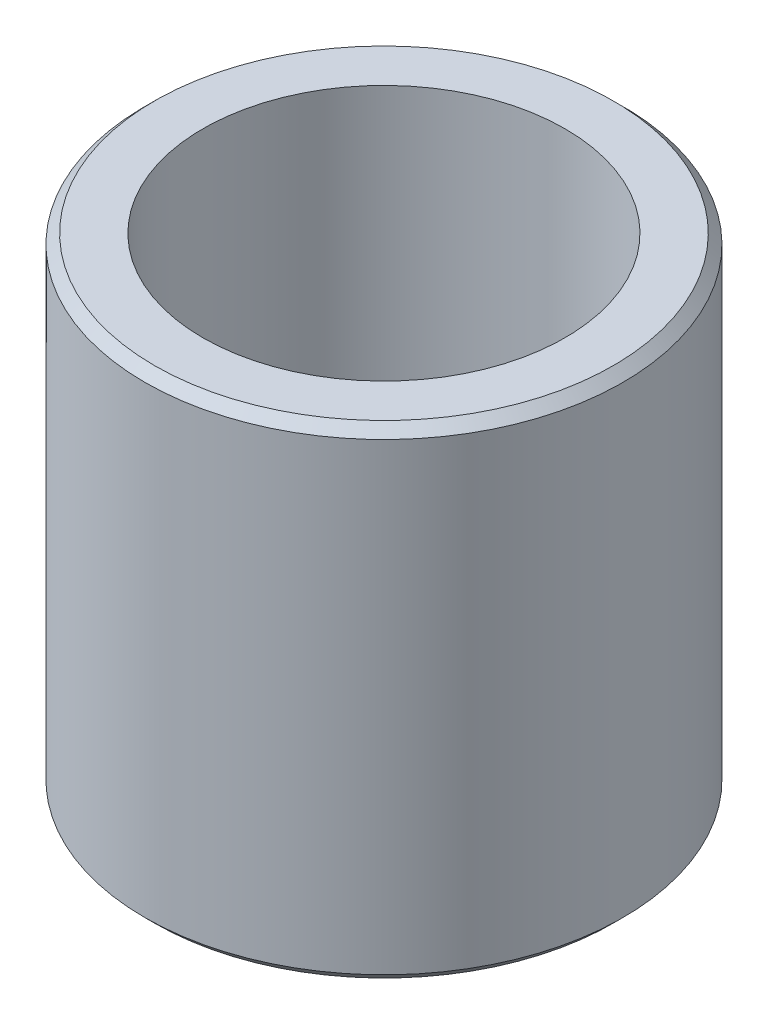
from build123d import *

# Parameters (mm, degrees)
SKETCH1_R           = 62.865
SKETCH1_R_2         = 47.625
BOSS_EXTRUDE1_DEPTH = 127
CHAMFER1_SIZE       = 2.54


with BuildPart() as part:
    # Sketch1 → Boss-Extrude1 (new body)
    with BuildSketch(Plane(origin=(0, 0, 0), x_dir=(1, 0, 0), z_dir=(0, 1, 0))):
        with Locations(Location((0, 0, 0), (0, 0, 270))):
            Circle(SKETCH1_R)
        with Locations(Location((0, 0, 0), (0, 0, 270))):
            Circle(SKETCH1_R_2, mode=Mode.SUBTRACT)
    extrude(amount=BOSS_EXTRUDE1_DEPTH)

    # Chamfer1
    chamfer1_edges = [part.edges().sort_by_distance(p)[0] for p in [
        (0, 0, -62.865),
        (0, 127, -62.865),
    ]]
    chamfer(chamfer1_edges, length=CHAMFER1_SIZE)


solid = part.part
